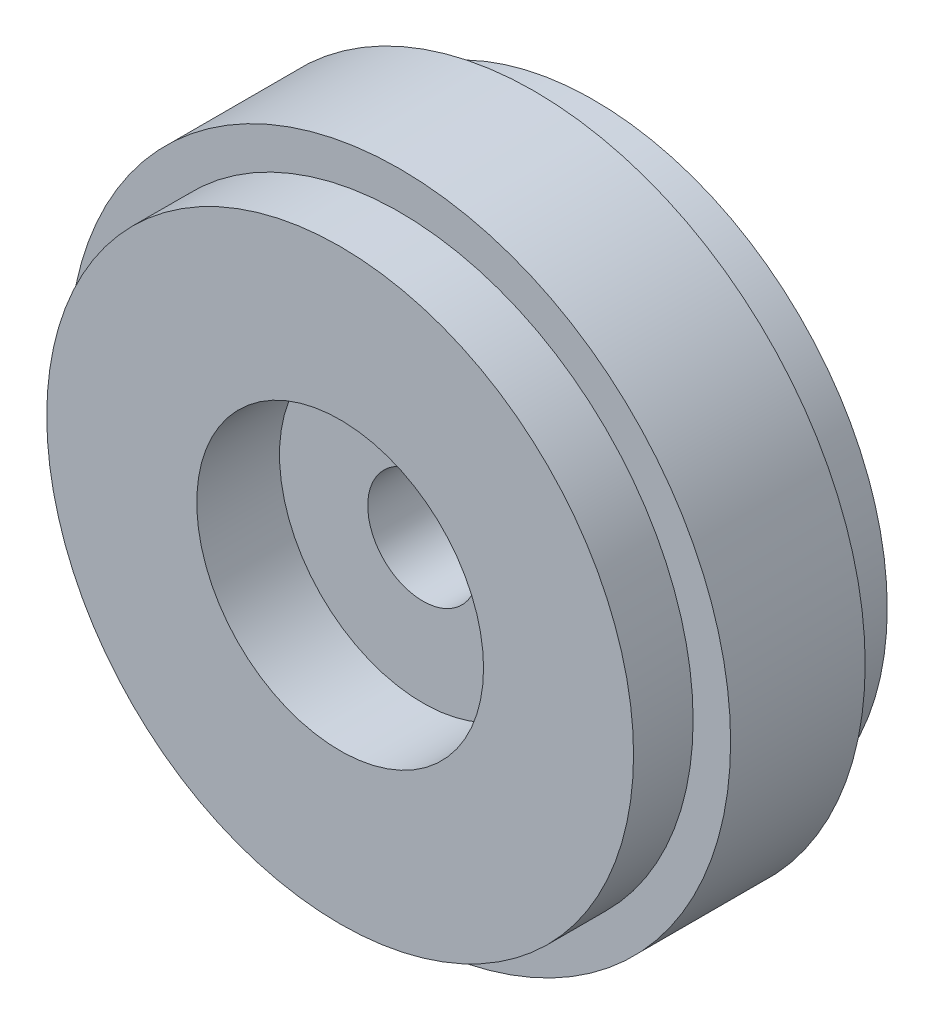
ISO-10303-21;
HEADER;
FILE_DESCRIPTION(('STEP AP214'),'2;1');
FILE_NAME('part.step','',(''),(''),'','','');
FILE_SCHEMA(('AUTOMOTIVE_DESIGN { 1 0 10303 214 1 1 1 1 }'));
ENDSEC;
DATA;
#1=APPLICATION_CONTEXT('core data for automotive mechanical design processes');
#2=APPLICATION_PROTOCOL_DEFINITION('international standard','automotive_design',2000,#1);
#3=PRODUCT_CONTEXT('',#1,'mechanical');
#4=PRODUCT('Part','Part','',(#3));
#5=PRODUCT_RELATED_PRODUCT_CATEGORY('part','',(#4));
#6=PRODUCT_DEFINITION_FORMATION('','',#4);
#7=PRODUCT_DEFINITION_CONTEXT('part definition',#1,'design');
#8=PRODUCT_DEFINITION('design','',#6,#7);
#9=PRODUCT_DEFINITION_SHAPE('','',#8);
#10=(LENGTH_UNIT() NAMED_UNIT(*) SI_UNIT(.MILLI.,.METRE.));
#11=(NAMED_UNIT(*) PLANE_ANGLE_UNIT() SI_UNIT($,.RADIAN.));
#12=(NAMED_UNIT(*) SI_UNIT($,.STERADIAN.) SOLID_ANGLE_UNIT());
#13=UNCERTAINTY_MEASURE_WITH_UNIT(LENGTH_MEASURE(1.E-05),#10,'distance_accuracy_value','');
#14=(GEOMETRIC_REPRESENTATION_CONTEXT(3) GLOBAL_UNCERTAINTY_ASSIGNED_CONTEXT((#13)) GLOBAL_UNIT_ASSIGNED_CONTEXT((#10,
#11,#12)) REPRESENTATION_CONTEXT('',''));
#15=CARTESIAN_POINT('',(0.,0.,0.));
#16=DIRECTION('',(0.,0.,1.));
#17=DIRECTION('',(1.,0.,0.));
#18=AXIS2_PLACEMENT_3D('',#15,#16,#17);
#19=CARTESIAN_POINT('',(0.,11.,-11.5));
#20=DIRECTION('',(0.,0.,1.));
#21=DIRECTION('',(1.,0.,0.));
#22=AXIS2_PLACEMENT_3D('',#19,#20,#21);
#23=PLANE('',#22);
#24=CARTESIAN_POINT('',(0.,0.,-11.5));
#25=DIRECTION('',(0.,0.,1.));
#26=DIRECTION('',(1.,0.,0.));
#27=AXIS2_PLACEMENT_3D('',#24,#25,#26);
#28=CIRCLE('',#27,11.);
#29=CARTESIAN_POINT('',(11.,0.,-11.5));
#30=VERTEX_POINT('',#29);
#31=EDGE_CURVE('E8',#30,#30,#28,.T.);
#32=ORIENTED_EDGE('',*,*,#31,.T.);
#33=EDGE_LOOP('',(#32));
#34=FACE_BOUND('',#33,.T.);
#35=CARTESIAN_POINT('',(0.,0.,-11.5));
#36=DIRECTION('',(0.,0.,1.));
#37=DIRECTION('',(1.,0.,0.));
#38=AXIS2_PLACEMENT_3D('',#35,#36,#37);
#39=CIRCLE('',#38,26.6);
#40=CARTESIAN_POINT('',(26.6,0.,-11.5));
#41=VERTEX_POINT('',#40);
#42=EDGE_CURVE('E15',#41,#41,#39,.T.);
#43=ORIENTED_EDGE('',*,*,#42,.F.);
#44=EDGE_LOOP('',(#43));
#45=FACE_BOUND('',#44,.T.);
#46=ADVANCED_FACE('F12',(#34,#45),#23,.F.);
#47=CARTESIAN_POINT('',(0.,30.,11.5));
#48=DIRECTION('',(0.,0.,-1.));
#49=DIRECTION('',(-1.,0.,0.));
#50=AXIS2_PLACEMENT_3D('',#47,#48,#49);
#51=PLANE('',#50);
#52=CARTESIAN_POINT('',(0.,0.,11.5));
#53=DIRECTION('',(0.,0.,1.));
#54=DIRECTION('',(1.,0.,0.));
#55=AXIS2_PLACEMENT_3D('',#52,#53,#54);
#56=CIRCLE('',#55,13.);
#57=CARTESIAN_POINT('',(13.,0.,11.5));
#58=VERTEX_POINT('',#57);
#59=EDGE_CURVE('E33',#58,#58,#56,.T.);
#60=ORIENTED_EDGE('',*,*,#59,.F.);
#61=EDGE_LOOP('',(#60));
#62=FACE_BOUND('',#61,.T.);
#63=CARTESIAN_POINT('',(0.,0.,11.5));
#64=DIRECTION('',(0.,0.,-1.));
#65=DIRECTION('',(-1.,0.,0.));
#66=AXIS2_PLACEMENT_3D('',#63,#64,#65);
#67=CIRCLE('',#66,26.6);
#68=CARTESIAN_POINT('',(-26.6,0.,11.5));
#69=VERTEX_POINT('',#68);
#70=EDGE_CURVE('E27',#69,#69,#67,.T.);
#71=ORIENTED_EDGE('',*,*,#70,.F.);
#72=EDGE_LOOP('',(#71));
#73=FACE_BOUND('',#72,.T.);
#74=ADVANCED_FACE('F75',(#62,#73),#51,.F.);
#75=CARTESIAN_POINT('',(0.,0.,2.9819902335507));
#76=DIRECTION('',(0.,0.,1.));
#77=DIRECTION('',(1.,0.,0.));
#78=AXIS2_PLACEMENT_3D('',#75,#76,#77);
#79=CYLINDRICAL_SURFACE('',#78,11.);
#80=ORIENTED_EDGE('',*,*,#31,.F.);
#81=EDGE_LOOP('',(#80));
#82=FACE_BOUND('',#81,.T.);
#83=CARTESIAN_POINT('',(0.,0.,-4.));
#84=DIRECTION('',(0.,0.,1.));
#85=DIRECTION('',(1.,0.,0.));
#86=AXIS2_PLACEMENT_3D('',#83,#84,#85);
#87=CIRCLE('',#86,11.);
#88=CARTESIAN_POINT('',(11.,0.,-4.));
#89=VERTEX_POINT('',#88);
#90=EDGE_CURVE('E19',#89,#89,#87,.T.);
#91=ORIENTED_EDGE('',*,*,#90,.T.);
#92=EDGE_LOOP('',(#91));
#93=FACE_BOUND('',#92,.T.);
#94=ADVANCED_FACE('F78',(#82,#93),#79,.F.);
#95=CARTESIAN_POINT('',(0.,5.,-4.));
#96=DIRECTION('',(0.,0.,1.));
#97=DIRECTION('',(1.,0.,0.));
#98=AXIS2_PLACEMENT_3D('',#95,#96,#97);
#99=PLANE('',#98);
#100=ORIENTED_EDGE('',*,*,#90,.F.);
#101=EDGE_LOOP('',(#100));
#102=FACE_BOUND('',#101,.T.);
#103=CARTESIAN_POINT('',(0.,0.,-4.));
#104=DIRECTION('',(0.,0.,1.));
#105=DIRECTION('',(1.,0.,0.));
#106=AXIS2_PLACEMENT_3D('',#103,#104,#105);
#107=CIRCLE('',#106,5.);
#108=CARTESIAN_POINT('',(5.,0.,-4.));
#109=VERTEX_POINT('',#108);
#110=EDGE_CURVE('E24',#109,#109,#107,.T.);
#111=ORIENTED_EDGE('',*,*,#110,.T.);
#112=EDGE_LOOP('',(#111));
#113=FACE_BOUND('',#112,.T.);
#114=ADVANCED_FACE('F54',(#102,#113),#99,.F.);
#115=CARTESIAN_POINT('',(0.,0.,2.9819902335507));
#116=DIRECTION('',(0.,0.,1.));
#117=DIRECTION('',(1.,0.,0.));
#118=AXIS2_PLACEMENT_3D('',#115,#116,#117);
#119=CYLINDRICAL_SURFACE('',#118,5.);
#120=ORIENTED_EDGE('',*,*,#110,.F.);
#121=EDGE_LOOP('',(#120));
#122=FACE_BOUND('',#121,.T.);
#123=CARTESIAN_POINT('',(0.,0.,4.));
#124=DIRECTION('',(0.,0.,1.));
#125=DIRECTION('',(1.,0.,0.));
#126=AXIS2_PLACEMENT_3D('',#123,#124,#125);
#127=CIRCLE('',#126,5.);
#128=CARTESIAN_POINT('',(5.,0.,4.));
#129=VERTEX_POINT('',#128);
#130=EDGE_CURVE('E49',#129,#129,#127,.T.);
#131=ORIENTED_EDGE('',*,*,#130,.T.);
#132=EDGE_LOOP('',(#131));
#133=FACE_BOUND('',#132,.T.);
#134=ADVANCED_FACE('F56',(#122,#133),#119,.F.);
#135=CARTESIAN_POINT('',(0.,13.,4.));
#136=DIRECTION('',(0.,0.,-1.));
#137=DIRECTION('',(-1.,0.,0.));
#138=AXIS2_PLACEMENT_3D('',#135,#136,#137);
#139=PLANE('',#138);
#140=ORIENTED_EDGE('',*,*,#130,.F.);
#141=EDGE_LOOP('',(#140));
#142=FACE_BOUND('',#141,.T.);
#143=CARTESIAN_POINT('',(0.,0.,4.));
#144=DIRECTION('',(0.,0.,1.));
#145=DIRECTION('',(1.,0.,0.));
#146=AXIS2_PLACEMENT_3D('',#143,#144,#145);
#147=CIRCLE('',#146,13.);
#148=CARTESIAN_POINT('',(13.,0.,4.));
#149=VERTEX_POINT('',#148);
#150=EDGE_CURVE('E46',#149,#149,#147,.T.);
#151=ORIENTED_EDGE('',*,*,#150,.T.);
#152=EDGE_LOOP('',(#151));
#153=FACE_BOUND('',#152,.T.);
#154=ADVANCED_FACE('F59',(#142,#153),#139,.F.);
#155=CARTESIAN_POINT('',(0.,0.,2.9819902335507));
#156=DIRECTION('',(0.,0.,1.));
#157=DIRECTION('',(1.,0.,0.));
#158=AXIS2_PLACEMENT_3D('',#155,#156,#157);
#159=CYLINDRICAL_SURFACE('',#158,13.);
#160=ORIENTED_EDGE('',*,*,#150,.F.);
#161=EDGE_LOOP('',(#160));
#162=FACE_BOUND('',#161,.T.);
#163=ORIENTED_EDGE('',*,*,#59,.T.);
#164=EDGE_LOOP('',(#163));
#165=FACE_BOUND('',#164,.T.);
#166=ADVANCED_FACE('F65',(#162,#165),#159,.F.);
#167=CARTESIAN_POINT('',(0.,0.,20.3459907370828));
#168=DIRECTION('',(0.,0.,1.));
#169=DIRECTION('',(1.,0.,0.));
#170=AXIS2_PLACEMENT_3D('',#167,#168,#169);
#171=CYLINDRICAL_SURFACE('',#170,26.6);
#172=CARTESIAN_POINT('',(0.,0.,-6.1));
#173=DIRECTION('',(0.,0.,1.));
#174=DIRECTION('',(1.,0.,0.));
#175=AXIS2_PLACEMENT_3D('',#172,#173,#174);
#176=CIRCLE('',#175,26.6);
#177=CARTESIAN_POINT('',(26.6,0.,-6.1));
#178=VERTEX_POINT('',#177);
#179=EDGE_CURVE('E35',#178,#178,#176,.T.);
#180=ORIENTED_EDGE('',*,*,#179,.F.);
#181=EDGE_LOOP('',(#180));
#182=FACE_BOUND('',#181,.T.);
#183=ORIENTED_EDGE('',*,*,#42,.T.);
#184=EDGE_LOOP('',(#183));
#185=FACE_BOUND('',#184,.T.);
#186=ADVANCED_FACE('F71',(#182,#185),#171,.T.);
#187=CARTESIAN_POINT('',(0.,0.,20.3459907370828));
#188=DIRECTION('',(0.,0.,1.));
#189=DIRECTION('',(1.,0.,0.));
#190=AXIS2_PLACEMENT_3D('',#187,#188,#189);
#191=CYLINDRICAL_SURFACE('',#190,26.6);
#192=CARTESIAN_POINT('',(0.,0.,6.1));
#193=DIRECTION('',(0.,0.,1.));
#194=DIRECTION('',(1.,0.,0.));
#195=AXIS2_PLACEMENT_3D('',#192,#193,#194);
#196=CIRCLE('',#195,26.6);
#197=CARTESIAN_POINT('',(26.6,0.,6.1));
#198=VERTEX_POINT('',#197);
#199=EDGE_CURVE('E40',#198,#198,#196,.T.);
#200=ORIENTED_EDGE('',*,*,#199,.T.);
#201=EDGE_LOOP('',(#200));
#202=FACE_BOUND('',#201,.T.);
#203=ORIENTED_EDGE('',*,*,#70,.T.);
#204=EDGE_LOOP('',(#203));
#205=FACE_BOUND('',#204,.T.);
#206=ADVANCED_FACE('F127',(#202,#205),#191,.T.);
#207=CARTESIAN_POINT('',(0.,0.,20.3459907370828));
#208=DIRECTION('',(0.,0.,1.));
#209=DIRECTION('',(1.,0.,0.));
#210=AXIS2_PLACEMENT_3D('',#207,#208,#209);
#211=CYLINDRICAL_SURFACE('',#210,30.);
#212=CARTESIAN_POINT('',(0.,0.,-6.1));
#213=DIRECTION('',(0.,0.,1.));
#214=DIRECTION('',(1.,0.,0.));
#215=AXIS2_PLACEMENT_3D('',#212,#213,#214);
#216=CIRCLE('',#215,30.);
#217=CARTESIAN_POINT('',(30.,0.,-6.1));
#218=VERTEX_POINT('',#217);
#219=EDGE_CURVE('E29',#218,#218,#216,.T.);
#220=ORIENTED_EDGE('',*,*,#219,.T.);
#221=EDGE_LOOP('',(#220));
#222=FACE_BOUND('',#221,.T.);
#223=CARTESIAN_POINT('',(0.,0.,6.1));
#224=DIRECTION('',(0.,0.,1.));
#225=DIRECTION('',(1.,0.,0.));
#226=AXIS2_PLACEMENT_3D('',#223,#224,#225);
#227=CIRCLE('',#226,30.);
#228=CARTESIAN_POINT('',(30.,0.,6.1));
#229=VERTEX_POINT('',#228);
#230=EDGE_CURVE('E189',#229,#229,#227,.T.);
#231=ORIENTED_EDGE('',*,*,#230,.F.);
#232=EDGE_LOOP('',(#231));
#233=FACE_BOUND('',#232,.T.);
#234=ADVANCED_FACE('F88',(#222,#233),#211,.T.);
#235=CARTESIAN_POINT('',(0.,26.6,-6.1));
#236=DIRECTION('',(0.,0.,-1.));
#237=DIRECTION('',(-1.,0.,0.));
#238=AXIS2_PLACEMENT_3D('',#235,#236,#237);
#239=PLANE('',#238);
#240=ORIENTED_EDGE('',*,*,#179,.T.);
#241=EDGE_LOOP('',(#240));
#242=FACE_BOUND('',#241,.T.);
#243=ORIENTED_EDGE('',*,*,#219,.F.);
#244=EDGE_LOOP('',(#243));
#245=FACE_BOUND('',#244,.T.);
#246=ADVANCED_FACE('F144',(#242,#245),#239,.T.);
#247=CARTESIAN_POINT('',(0.,30.,6.1));
#248=DIRECTION('',(0.,0.,1.));
#249=DIRECTION('',(1.,0.,0.));
#250=AXIS2_PLACEMENT_3D('',#247,#248,#249);
#251=PLANE('',#250);
#252=ORIENTED_EDGE('',*,*,#230,.T.);
#253=EDGE_LOOP('',(#252));
#254=FACE_BOUND('',#253,.T.);
#255=ORIENTED_EDGE('',*,*,#199,.F.);
#256=EDGE_LOOP('',(#255));
#257=FACE_BOUND('',#256,.T.);
#258=ADVANCED_FACE('F151',(#254,#257),#251,.T.);
#259=CLOSED_SHELL('',(#46,#74,#94,#114,#134,#154,#166,#186,#206,#234,#246,#258));
#260=MANIFOLD_SOLID_BREP('B1',#259);
#261=ADVANCED_BREP_SHAPE_REPRESENTATION('',(#18,#260),#14);
#262=SHAPE_DEFINITION_REPRESENTATION(#9,#261);
ENDSEC;
END-ISO-10303-21;
